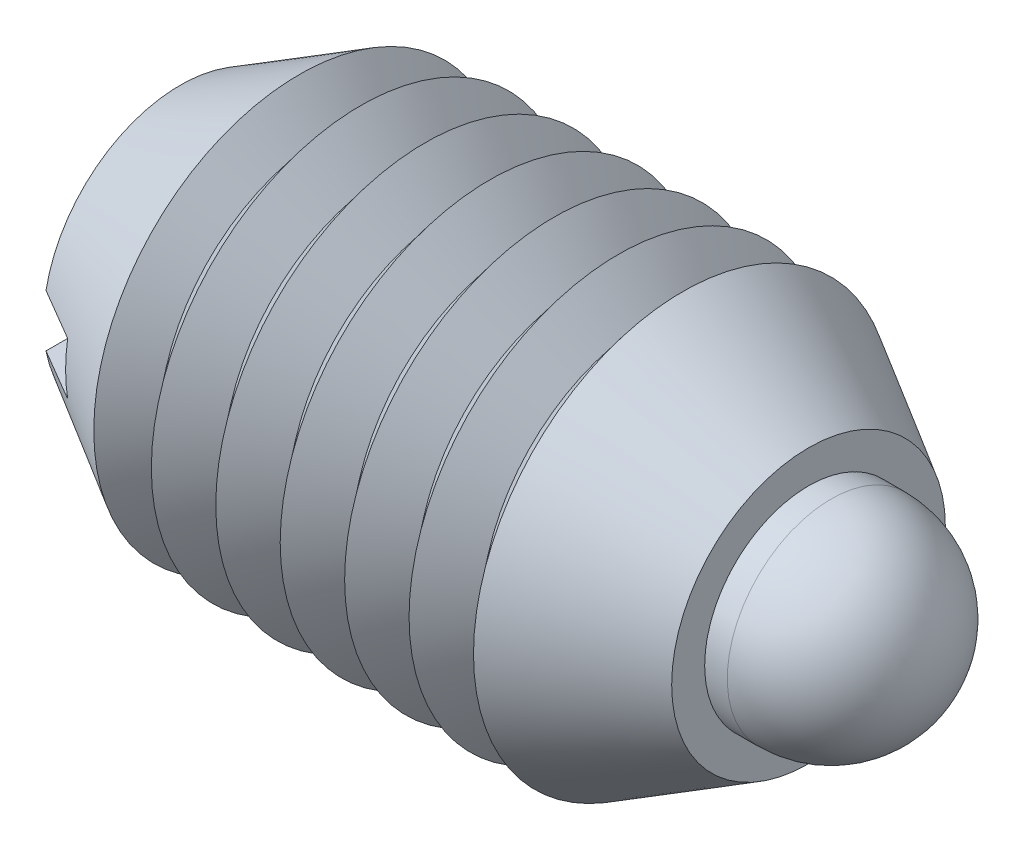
ISO-10303-21;
HEADER;
FILE_DESCRIPTION(('STEP AP214'),'2;1');
FILE_NAME('part.step','',(''),(''),'','','');
FILE_SCHEMA(('AUTOMOTIVE_DESIGN { 1 0 10303 214 1 1 1 1 }'));
ENDSEC;
DATA;
#1=APPLICATION_CONTEXT('core data for automotive mechanical design processes');
#2=APPLICATION_PROTOCOL_DEFINITION('international standard','automotive_design',2000,#1);
#3=PRODUCT_CONTEXT('',#1,'mechanical');
#4=PRODUCT('Part','Part','',(#3));
#5=PRODUCT_RELATED_PRODUCT_CATEGORY('part','',(#4));
#6=PRODUCT_DEFINITION_FORMATION('','',#4);
#7=PRODUCT_DEFINITION_CONTEXT('part definition',#1,'design');
#8=PRODUCT_DEFINITION('design','',#6,#7);
#9=PRODUCT_DEFINITION_SHAPE('','',#8);
#10=(LENGTH_UNIT() NAMED_UNIT(*) SI_UNIT(.MILLI.,.METRE.));
#11=(NAMED_UNIT(*) PLANE_ANGLE_UNIT() SI_UNIT($,.RADIAN.));
#12=(NAMED_UNIT(*) SI_UNIT($,.STERADIAN.) SOLID_ANGLE_UNIT());
#13=UNCERTAINTY_MEASURE_WITH_UNIT(LENGTH_MEASURE(1.E-05),#10,'distance_accuracy_value','');
#14=(GEOMETRIC_REPRESENTATION_CONTEXT(3) GLOBAL_UNCERTAINTY_ASSIGNED_CONTEXT((#13)) GLOBAL_UNIT_ASSIGNED_CONTEXT((#10,
#11,#12)) REPRESENTATION_CONTEXT('',''));
#15=CARTESIAN_POINT('',(0.,0.,0.));
#16=DIRECTION('',(0.,0.,1.));
#17=DIRECTION('',(1.,0.,0.));
#18=AXIS2_PLACEMENT_3D('',#15,#16,#17);
#19=CARTESIAN_POINT('',(11.80592,0.,0.));
#20=DIRECTION('',(-1.,0.,0.));
#21=DIRECTION('',(0.,-0.719424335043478,-0.694570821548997));
#22=AXIS2_PLACEMENT_3D('',#19,#20,#21);
#23=PLANE('',#22);
#24=CARTESIAN_POINT('',(11.80592,0.,0.));
#25=DIRECTION('',(1.,0.,0.));
#26=DIRECTION('',(0.,0.719424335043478,0.694570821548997));
#27=AXIS2_PLACEMENT_3D('',#24,#25,#26);
#28=CIRCLE('',#27,3.1496);
#29=CARTESIAN_POINT('',(11.80592,2.26589888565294,2.18762025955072));
#30=VERTEX_POINT('',#29);
#31=EDGE_CURVE('P0_E10',#30,#30,#28,.T.);
#32=ORIENTED_EDGE('',*,*,#31,.F.);
#33=EDGE_LOOP('',(#32));
#34=FACE_BOUND('',#33,.T.);
#35=ADVANCED_FACE('P0_F14',(#34),#23,.T.);
#36=CARTESIAN_POINT('',(12.43584,0.,0.));
#37=DIRECTION('',(1.,0.,0.));
#38=DIRECTION('',(0.,0.719424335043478,0.694570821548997));
#39=AXIS2_PLACEMENT_3D('',#36,#37,#38);
#40=CONICAL_SURFACE('',#39,3.77952,0.785398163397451);
#41=ORIENTED_EDGE('',*,*,#31,.T.);
#42=EDGE_LOOP('',(#41));
#43=FACE_BOUND('',#42,.T.);
#44=CARTESIAN_POINT('',(12.43584,0.,0.));
#45=DIRECTION('',(1.,0.,0.));
#46=DIRECTION('',(0.,0.719424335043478,0.694570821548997));
#47=AXIS2_PLACEMENT_3D('',#44,#45,#46);
#48=CIRCLE('',#47,3.77952);
#49=CARTESIAN_POINT('',(12.43584,2.71907866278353,2.62514431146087));
#50=VERTEX_POINT('',#49);
#51=EDGE_CURVE('P0_E20',#50,#50,#48,.T.);
#52=ORIENTED_EDGE('',*,*,#51,.F.);
#53=EDGE_LOOP('',(#52));
#54=FACE_BOUND('',#53,.T.);
#55=ADVANCED_FACE('P0_F54',(#43,#54),#40,.T.);
#56=CARTESIAN_POINT('',(22.8854,0.,0.));
#57=DIRECTION('',(1.,0.,0.));
#58=DIRECTION('',(0.,0.719424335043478,0.694570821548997));
#59=AXIS2_PLACEMENT_3D('',#56,#57,#58);
#60=CYLINDRICAL_SURFACE('',#59,3.77952);
#61=ORIENTED_EDGE('',*,*,#51,.T.);
#62=EDGE_LOOP('',(#61));
#63=FACE_BOUND('',#62,.T.);
#64=CARTESIAN_POINT('',(17.0140665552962,0.,0.));
#65=DIRECTION('',(1.,0.,0.));
#66=DIRECTION('',(0.,0.719424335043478,0.694570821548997));
#67=AXIS2_PLACEMENT_3D('',#64,#65,#66);
#68=CIRCLE('',#67,3.77952);
#69=CARTESIAN_POINT('',(17.0140665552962,2.71907866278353,2.62514431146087));
#70=VERTEX_POINT('',#69);
#71=EDGE_CURVE('P0_E24',#70,#70,#68,.T.);
#72=ORIENTED_EDGE('',*,*,#71,.F.);
#73=EDGE_LOOP('',(#72));
#74=FACE_BOUND('',#73,.T.);
#75=ADVANCED_FACE('P0_F50',(#63,#74),#60,.T.);
#76=CARTESIAN_POINT('',(18.10512,0.,0.));
#77=DIRECTION('',(-1.,0.,0.));
#78=DIRECTION('',(0.,-0.719424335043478,-0.694570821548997));
#79=AXIS2_PLACEMENT_3D('',#76,#77,#78);
#80=CONICAL_SURFACE('',#79,3.1496,0.523598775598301);
#81=ORIENTED_EDGE('',*,*,#71,.T.);
#82=EDGE_LOOP('',(#81));
#83=FACE_BOUND('',#82,.T.);
#84=CARTESIAN_POINT('',(18.10512,0.,0.));
#85=DIRECTION('',(1.,0.,0.));
#86=DIRECTION('',(0.,0.719424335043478,0.694570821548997));
#87=AXIS2_PLACEMENT_3D('',#84,#85,#86);
#88=CIRCLE('',#87,3.1496);
#89=CARTESIAN_POINT('',(18.10512,2.26589888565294,2.18762025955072));
#90=VERTEX_POINT('',#89);
#91=EDGE_CURVE('P0_E28',#90,#90,#88,.T.);
#92=ORIENTED_EDGE('',*,*,#91,.F.);
#93=EDGE_LOOP('',(#92));
#94=FACE_BOUND('',#93,.T.);
#95=ADVANCED_FACE('P0_F41',(#83,#94),#80,.T.);
#96=CARTESIAN_POINT('',(22.8854,0.,0.));
#97=DIRECTION('',(1.,0.,0.));
#98=DIRECTION('',(0.,0.719424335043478,0.694570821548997));
#99=AXIS2_PLACEMENT_3D('',#96,#97,#98);
#100=CYLINDRICAL_SURFACE('',#99,3.1496);
#101=ORIENTED_EDGE('',*,*,#91,.T.);
#102=EDGE_LOOP('',(#101));
#103=FACE_BOUND('',#102,.T.);
#104=CARTESIAN_POINT('',(19.7358,0.,0.));
#105=DIRECTION('',(1.,0.,0.));
#106=DIRECTION('',(0.,0.719424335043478,0.694570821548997));
#107=AXIS2_PLACEMENT_3D('',#104,#105,#106);
#108=CIRCLE('',#107,3.1496);
#109=CARTESIAN_POINT('',(19.7358,2.26589888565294,2.18762025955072));
#110=VERTEX_POINT('',#109);
#111=EDGE_CURVE('P0_E33',#110,#110,#108,.T.);
#112=ORIENTED_EDGE('',*,*,#111,.F.);
#113=EDGE_LOOP('',(#112));
#114=FACE_BOUND('',#113,.T.);
#115=ADVANCED_FACE('P0_F39',(#103,#114),#100,.T.);
#116=CARTESIAN_POINT('',(19.7358,0.,0.));
#117=DIRECTION('',(1.,0.,0.));
#118=DIRECTION('',(0.,0.719424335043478,0.694570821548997));
#119=AXIS2_PLACEMENT_3D('',#116,#117,#118);
#120=SPHERICAL_SURFACE('',#119,3.1496);
#121=ORIENTED_EDGE('',*,*,#111,.T.);
#122=EDGE_LOOP('',(#121));
#123=FACE_BOUND('',#122,.T.);
#124=ADVANCED_FACE('P0_F37',(#123),#120,.T.);
#125=CLOSED_SHELL('',(#35,#55,#75,#95,#115,#124));
#126=MANIFOLD_SOLID_BREP('P0_B1',#125);
#127=CARTESIAN_POINT('',(19.05,0.,0.));
#128=DIRECTION('',(1.,0.,0.));
#129=DIRECTION('',(0.,0.,-1.));
#130=AXIS2_PLACEMENT_3D('',#127,#128,#129);
#131=PLANE('',#130);
#132=CARTESIAN_POINT('',(19.05,0.,0.));
#133=DIRECTION('',(1.,0.,0.));
#134=DIRECTION('',(0.,0.,-1.));
#135=AXIS2_PLACEMENT_3D('',#132,#133,#134);
#136=CIRCLE('',#135,4.15029547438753);
#137=CARTESIAN_POINT('',(19.05,0.,-4.15029547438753));
#138=VERTEX_POINT('',#137);
#139=EDGE_CURVE('P1_E78',#138,#138,#136,.T.);
#140=ORIENTED_EDGE('',*,*,#139,.T.);
#141=EDGE_LOOP('',(#140));
#142=FACE_BOUND('',#141,.T.);
#143=CARTESIAN_POINT('',(19.05,0.,0.));
#144=DIRECTION('',(-1.,0.,0.));
#145=DIRECTION('',(0.,0.,1.));
#146=AXIS2_PLACEMENT_3D('',#143,#144,#145);
#147=CIRCLE('',#146,3.1496);
#148=CARTESIAN_POINT('',(19.05,0.,3.1496));
#149=VERTEX_POINT('',#148);
#150=EDGE_CURVE('P1_E65',#149,#149,#147,.T.);
#151=ORIENTED_EDGE('',*,*,#150,.T.);
#152=EDGE_LOOP('',(#151));
#153=FACE_BOUND('',#152,.T.);
#154=ADVANCED_FACE('P1_F15',(#142,#153),#131,.T.);
#155=CARTESIAN_POINT('',(19.05,0.,0.));
#156=DIRECTION('',(-1.,0.,0.));
#157=DIRECTION('',(0.,0.,1.));
#158=AXIS2_PLACEMENT_3D('',#155,#156,#157);
#159=CONICAL_SURFACE('',#158,4.15029547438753,0.523598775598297);
#160=CARTESIAN_POINT('',(15.24,0.,0.));
#161=DIRECTION('',(-1.,0.,0.));
#162=DIRECTION('',(0.,0.,1.));
#163=AXIS2_PLACEMENT_3D('',#160,#161,#162);
#164=CIRCLE('',#163,6.35);
#165=CARTESIAN_POINT('',(15.24,0.,6.35));
#166=VERTEX_POINT('',#165);
#167=EDGE_CURVE('P1_E127',#166,#166,#164,.T.);
#168=ORIENTED_EDGE('',*,*,#167,.F.);
#169=EDGE_LOOP('',(#168));
#170=FACE_BOUND('',#169,.T.);
#171=ORIENTED_EDGE('',*,*,#139,.F.);
#172=EDGE_LOOP('',(#171));
#173=FACE_BOUND('',#172,.T.);
#174=ADVANCED_FACE('P1_F17',(#170,#173),#159,.T.);
#175=CARTESIAN_POINT('',(0.,0.,0.));
#176=DIRECTION('',(-1.,0.,0.));
#177=DIRECTION('',(0.,0.,1.));
#178=AXIS2_PLACEMENT_3D('',#175,#176,#177);
#179=CYLINDRICAL_SURFACE('',#178,3.1496);
#180=CARTESIAN_POINT('',(18.10512,0.,0.));
#181=DIRECTION('',(-1.,0.,0.));
#182=DIRECTION('',(0.,0.,1.));
#183=AXIS2_PLACEMENT_3D('',#180,#181,#182);
#184=CIRCLE('',#183,3.1496);
#185=CARTESIAN_POINT('',(18.10512,0.,3.1496));
#186=VERTEX_POINT('',#185);
#187=EDGE_CURVE('P1_E115',#186,#186,#184,.T.);
#188=ORIENTED_EDGE('',*,*,#187,.T.);
#189=EDGE_LOOP('',(#188));
#190=FACE_BOUND('',#189,.T.);
#191=ORIENTED_EDGE('',*,*,#150,.F.);
#192=EDGE_LOOP('',(#191));
#193=FACE_BOUND('',#192,.T.);
#194=ADVANCED_FACE('P1_F184',(#190,#193),#179,.F.);
#195=CARTESIAN_POINT('',(18.10512,0.,0.));
#196=DIRECTION('',(-1.,0.,0.));
#197=DIRECTION('',(0.,0.,1.));
#198=AXIS2_PLACEMENT_3D('',#195,#196,#197);
#199=CONICAL_SURFACE('',#198,3.1496,0.785398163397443);
#200=CARTESIAN_POINT('',(17.4752,0.,0.));
#201=DIRECTION('',(-1.,0.,0.));
#202=DIRECTION('',(0.,0.,1.));
#203=AXIS2_PLACEMENT_3D('',#200,#201,#202);
#204=CIRCLE('',#203,3.77952);
#205=CARTESIAN_POINT('',(17.4752,0.,3.77952));
#206=VERTEX_POINT('',#205);
#207=EDGE_CURVE('P1_E118',#206,#206,#204,.T.);
#208=ORIENTED_EDGE('',*,*,#207,.T.);
#209=EDGE_LOOP('',(#208));
#210=FACE_BOUND('',#209,.T.);
#211=ORIENTED_EDGE('',*,*,#187,.F.);
#212=EDGE_LOOP('',(#211));
#213=FACE_BOUND('',#212,.T.);
#214=ADVANCED_FACE('P1_F191',(#210,#213),#199,.F.);
#215=CARTESIAN_POINT('',(0.,0.,0.));
#216=DIRECTION('',(-1.,0.,0.));
#217=DIRECTION('',(0.,0.,1.));
#218=AXIS2_PLACEMENT_3D('',#215,#216,#217);
#219=CYLINDRICAL_SURFACE('',#218,3.77952);
#220=CARTESIAN_POINT('',(4.7625,0.,0.));
#221=DIRECTION('',(-1.,0.,0.));
#222=DIRECTION('',(0.,0.,1.));
#223=AXIS2_PLACEMENT_3D('',#220,#221,#222);
#224=CIRCLE('',#223,3.77952);
#225=CARTESIAN_POINT('',(4.7625,0.,3.77952));
#226=VERTEX_POINT('',#225);
#227=EDGE_CURVE('P1_E121',#226,#226,#224,.T.);
#228=ORIENTED_EDGE('',*,*,#227,.T.);
#229=EDGE_LOOP('',(#228));
#230=FACE_BOUND('',#229,.T.);
#231=ORIENTED_EDGE('',*,*,#207,.F.);
#232=EDGE_LOOP('',(#231));
#233=FACE_BOUND('',#232,.T.);
#234=ADVANCED_FACE('P1_F196',(#230,#233),#219,.F.);
#235=CARTESIAN_POINT('',(4.7625,0.,0.));
#236=DIRECTION('',(1.,0.,0.));
#237=DIRECTION('',(0.,0.,-1.));
#238=AXIS2_PLACEMENT_3D('',#235,#236,#237);
#239=PLANE('',#238);
#240=ORIENTED_EDGE('',*,*,#227,.F.);
#241=EDGE_LOOP('',(#240));
#242=FACE_BOUND('',#241,.T.);
#243=ADVANCED_FACE('P1_F202',(#242),#239,.T.);
#244=CARTESIAN_POINT('',(14.2630769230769,0.,0.));
#245=DIRECTION('',(1.,0.,0.));
#246=DIRECTION('',(0.,0.,-1.));
#247=AXIS2_PLACEMENT_3D('',#244,#245,#246);
#248=CONICAL_SURFACE('',#247,5.12982346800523,0.895664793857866);
#249=ORIENTED_EDGE('',*,*,#167,.T.);
#250=EDGE_LOOP('',(#249));
#251=FACE_BOUND('',#250,.T.);
#252=CARTESIAN_POINT('',(14.2630769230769,0.,0.));
#253=DIRECTION('',(-1.,0.,0.));
#254=DIRECTION('',(0.,0.,1.));
#255=AXIS2_PLACEMENT_3D('',#252,#253,#254);
#256=CIRCLE('',#255,5.12982346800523);
#257=CARTESIAN_POINT('',(14.2630769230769,0.,5.12982346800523));
#258=VERTEX_POINT('',#257);
#259=EDGE_CURVE('P1_E124',#258,#258,#256,.T.);
#260=ORIENTED_EDGE('',*,*,#259,.F.);
#261=EDGE_LOOP('',(#260));
#262=FACE_BOUND('',#261,.T.);
#263=ADVANCED_FACE('P1_F206',(#251,#262),#248,.T.);
#264=CARTESIAN_POINT('',(13.2861538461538,0.,0.));
#265=DIRECTION('',(-1.,0.,0.));
#266=DIRECTION('',(0.,0.,1.));
#267=AXIS2_PLACEMENT_3D('',#264,#265,#266);
#268=CONICAL_SURFACE('',#267,6.35,0.895664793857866);
#269=ORIENTED_EDGE('',*,*,#259,.T.);
#270=EDGE_LOOP('',(#269));
#271=FACE_BOUND('',#270,.T.);
#272=CARTESIAN_POINT('',(13.2861538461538,0.,0.));
#273=DIRECTION('',(-1.,0.,0.));
#274=DIRECTION('',(0.,0.,1.));
#275=AXIS2_PLACEMENT_3D('',#272,#273,#274);
#276=CIRCLE('',#275,6.35);
#277=CARTESIAN_POINT('',(13.2861538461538,0.,6.35));
#278=VERTEX_POINT('',#277);
#279=EDGE_CURVE('P1_E133',#278,#278,#276,.T.);
#280=ORIENTED_EDGE('',*,*,#279,.F.);
#281=EDGE_LOOP('',(#280));
#282=FACE_BOUND('',#281,.T.);
#283=ADVANCED_FACE('P1_F210',(#271,#282),#268,.T.);
#284=CARTESIAN_POINT('',(12.3092307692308,0.,0.));
#285=DIRECTION('',(1.,0.,0.));
#286=DIRECTION('',(0.,0.,-1.));
#287=AXIS2_PLACEMENT_3D('',#284,#285,#286);
#288=CONICAL_SURFACE('',#287,5.12982346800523,0.895664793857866);
#289=ORIENTED_EDGE('',*,*,#279,.T.);
#290=EDGE_LOOP('',(#289));
#291=FACE_BOUND('',#290,.T.);
#292=CARTESIAN_POINT('',(12.3092307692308,0.,0.));
#293=DIRECTION('',(-1.,0.,0.));
#294=DIRECTION('',(0.,0.,1.));
#295=AXIS2_PLACEMENT_3D('',#292,#293,#294);
#296=CIRCLE('',#295,5.12982346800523);
#297=CARTESIAN_POINT('',(12.3092307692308,0.,5.12982346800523));
#298=VERTEX_POINT('',#297);
#299=EDGE_CURVE('P1_E130',#298,#298,#296,.T.);
#300=ORIENTED_EDGE('',*,*,#299,.F.);
#301=EDGE_LOOP('',(#300));
#302=FACE_BOUND('',#301,.T.);
#303=ADVANCED_FACE('P1_F214',(#291,#302),#288,.T.);
#304=CARTESIAN_POINT('',(11.3323076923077,0.,0.));
#305=DIRECTION('',(-1.,0.,0.));
#306=DIRECTION('',(0.,0.,1.));
#307=AXIS2_PLACEMENT_3D('',#304,#305,#306);
#308=CONICAL_SURFACE('',#307,6.35,0.895664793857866);
#309=ORIENTED_EDGE('',*,*,#299,.T.);
#310=EDGE_LOOP('',(#309));
#311=FACE_BOUND('',#310,.T.);
#312=CARTESIAN_POINT('',(11.3323076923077,0.,0.));
#313=DIRECTION('',(-1.,0.,0.));
#314=DIRECTION('',(0.,0.,1.));
#315=AXIS2_PLACEMENT_3D('',#312,#313,#314);
#316=CIRCLE('',#315,6.35);
#317=CARTESIAN_POINT('',(11.3323076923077,0.,6.35));
#318=VERTEX_POINT('',#317);
#319=EDGE_CURVE('P1_E139',#318,#318,#316,.T.);
#320=ORIENTED_EDGE('',*,*,#319,.F.);
#321=EDGE_LOOP('',(#320));
#322=FACE_BOUND('',#321,.T.);
#323=ADVANCED_FACE('P1_F218',(#311,#322),#308,.T.);
#324=CARTESIAN_POINT('',(10.3553846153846,0.,0.));
#325=DIRECTION('',(1.,0.,0.));
#326=DIRECTION('',(0.,0.,-1.));
#327=AXIS2_PLACEMENT_3D('',#324,#325,#326);
#328=CONICAL_SURFACE('',#327,5.12982346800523,0.895664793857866);
#329=ORIENTED_EDGE('',*,*,#319,.T.);
#330=EDGE_LOOP('',(#329));
#331=FACE_BOUND('',#330,.T.);
#332=CARTESIAN_POINT('',(10.3553846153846,0.,0.));
#333=DIRECTION('',(-1.,0.,0.));
#334=DIRECTION('',(0.,0.,1.));
#335=AXIS2_PLACEMENT_3D('',#332,#333,#334);
#336=CIRCLE('',#335,5.12982346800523);
#337=CARTESIAN_POINT('',(10.3553846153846,0.,5.12982346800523));
#338=VERTEX_POINT('',#337);
#339=EDGE_CURVE('P1_E136',#338,#338,#336,.T.);
#340=ORIENTED_EDGE('',*,*,#339,.F.);
#341=EDGE_LOOP('',(#340));
#342=FACE_BOUND('',#341,.T.);
#343=ADVANCED_FACE('P1_F222',(#331,#342),#328,.T.);
#344=CARTESIAN_POINT('',(9.37846153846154,0.,0.));
#345=DIRECTION('',(-1.,0.,0.));
#346=DIRECTION('',(0.,0.,1.));
#347=AXIS2_PLACEMENT_3D('',#344,#345,#346);
#348=CONICAL_SURFACE('',#347,6.35,0.895664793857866);
#349=ORIENTED_EDGE('',*,*,#339,.T.);
#350=EDGE_LOOP('',(#349));
#351=FACE_BOUND('',#350,.T.);
#352=CARTESIAN_POINT('',(9.37846153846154,0.,0.));
#353=DIRECTION('',(-1.,0.,0.));
#354=DIRECTION('',(0.,0.,1.));
#355=AXIS2_PLACEMENT_3D('',#352,#353,#354);
#356=CIRCLE('',#355,6.35);
#357=CARTESIAN_POINT('',(9.37846153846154,0.,6.35));
#358=VERTEX_POINT('',#357);
#359=EDGE_CURVE('P1_E145',#358,#358,#356,.T.);
#360=ORIENTED_EDGE('',*,*,#359,.F.);
#361=EDGE_LOOP('',(#360));
#362=FACE_BOUND('',#361,.T.);
#363=ADVANCED_FACE('P1_F226',(#351,#362),#348,.T.);
#364=CARTESIAN_POINT('',(8.40153846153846,0.,0.));
#365=DIRECTION('',(1.,0.,0.));
#366=DIRECTION('',(0.,0.,-1.));
#367=AXIS2_PLACEMENT_3D('',#364,#365,#366);
#368=CONICAL_SURFACE('',#367,5.12982346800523,0.895664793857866);
#369=ORIENTED_EDGE('',*,*,#359,.T.);
#370=EDGE_LOOP('',(#369));
#371=FACE_BOUND('',#370,.T.);
#372=CARTESIAN_POINT('',(8.40153846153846,0.,0.));
#373=DIRECTION('',(-1.,0.,0.));
#374=DIRECTION('',(0.,0.,1.));
#375=AXIS2_PLACEMENT_3D('',#372,#373,#374);
#376=CIRCLE('',#375,5.12982346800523);
#377=CARTESIAN_POINT('',(8.40153846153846,0.,5.12982346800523));
#378=VERTEX_POINT('',#377);
#379=EDGE_CURVE('P1_E142',#378,#378,#376,.T.);
#380=ORIENTED_EDGE('',*,*,#379,.F.);
#381=EDGE_LOOP('',(#380));
#382=FACE_BOUND('',#381,.T.);
#383=ADVANCED_FACE('P1_F230',(#371,#382),#368,.T.);
#384=CARTESIAN_POINT('',(7.42461538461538,0.,0.));
#385=DIRECTION('',(-1.,0.,0.));
#386=DIRECTION('',(0.,0.,1.));
#387=AXIS2_PLACEMENT_3D('',#384,#385,#386);
#388=CONICAL_SURFACE('',#387,6.35,0.895664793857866);
#389=ORIENTED_EDGE('',*,*,#379,.T.);
#390=EDGE_LOOP('',(#389));
#391=FACE_BOUND('',#390,.T.);
#392=CARTESIAN_POINT('',(7.42461538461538,0.,0.));
#393=DIRECTION('',(-1.,0.,0.));
#394=DIRECTION('',(0.,0.,1.));
#395=AXIS2_PLACEMENT_3D('',#392,#393,#394);
#396=CIRCLE('',#395,6.35);
#397=CARTESIAN_POINT('',(7.42461538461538,0.,6.35));
#398=VERTEX_POINT('',#397);
#399=EDGE_CURVE('P1_E151',#398,#398,#396,.T.);
#400=ORIENTED_EDGE('',*,*,#399,.F.);
#401=EDGE_LOOP('',(#400));
#402=FACE_BOUND('',#401,.T.);
#403=ADVANCED_FACE('P1_F176',(#391,#402),#388,.T.);
#404=CARTESIAN_POINT('',(6.44769230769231,0.,0.));
#405=DIRECTION('',(1.,0.,0.));
#406=DIRECTION('',(0.,0.,-1.));
#407=AXIS2_PLACEMENT_3D('',#404,#405,#406);
#408=CONICAL_SURFACE('',#407,5.12982346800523,0.895664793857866);
#409=ORIENTED_EDGE('',*,*,#399,.T.);
#410=EDGE_LOOP('',(#409));
#411=FACE_BOUND('',#410,.T.);
#412=CARTESIAN_POINT('',(6.44769230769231,0.,0.));
#413=DIRECTION('',(-1.,0.,0.));
#414=DIRECTION('',(0.,0.,1.));
#415=AXIS2_PLACEMENT_3D('',#412,#413,#414);
#416=CIRCLE('',#415,5.12982346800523);
#417=CARTESIAN_POINT('',(6.44769230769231,0.,5.12982346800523));
#418=VERTEX_POINT('',#417);
#419=EDGE_CURVE('P1_E148',#418,#418,#416,.T.);
#420=ORIENTED_EDGE('',*,*,#419,.F.);
#421=EDGE_LOOP('',(#420));
#422=FACE_BOUND('',#421,.T.);
#423=ADVANCED_FACE('P1_F166',(#411,#422),#408,.T.);
#424=CARTESIAN_POINT('',(5.47076923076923,0.,0.));
#425=DIRECTION('',(-1.,0.,0.));
#426=DIRECTION('',(0.,0.,1.));
#427=AXIS2_PLACEMENT_3D('',#424,#425,#426);
#428=CONICAL_SURFACE('',#427,6.35,0.895664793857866);
#429=ORIENTED_EDGE('',*,*,#419,.T.);
#430=EDGE_LOOP('',(#429));
#431=FACE_BOUND('',#430,.T.);
#432=CARTESIAN_POINT('',(5.47076923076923,0.,0.));
#433=DIRECTION('',(-1.,0.,0.));
#434=DIRECTION('',(0.,0.,1.));
#435=AXIS2_PLACEMENT_3D('',#432,#433,#434);
#436=CIRCLE('',#435,6.35);
#437=CARTESIAN_POINT('',(5.47076923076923,0.,6.35));
#438=VERTEX_POINT('',#437);
#439=EDGE_CURVE('P1_E157',#438,#438,#436,.T.);
#440=ORIENTED_EDGE('',*,*,#439,.F.);
#441=EDGE_LOOP('',(#440));
#442=FACE_BOUND('',#441,.T.);
#443=ADVANCED_FACE('P1_F164',(#431,#442),#428,.T.);
#444=CARTESIAN_POINT('',(4.49384615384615,0.,0.));
#445=DIRECTION('',(1.,0.,0.));
#446=DIRECTION('',(0.,0.,-1.));
#447=AXIS2_PLACEMENT_3D('',#444,#445,#446);
#448=CONICAL_SURFACE('',#447,5.12982346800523,0.895664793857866);
#449=ORIENTED_EDGE('',*,*,#439,.T.);
#450=EDGE_LOOP('',(#449));
#451=FACE_BOUND('',#450,.T.);
#452=CARTESIAN_POINT('',(4.49384615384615,0.,0.));
#453=DIRECTION('',(-1.,0.,0.));
#454=DIRECTION('',(0.,0.,1.));
#455=AXIS2_PLACEMENT_3D('',#452,#453,#454);
#456=CIRCLE('',#455,5.12982346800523);
#457=CARTESIAN_POINT('',(4.49384615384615,0.,5.12982346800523));
#458=VERTEX_POINT('',#457);
#459=EDGE_CURVE('P1_E154',#458,#458,#456,.T.);
#460=ORIENTED_EDGE('',*,*,#459,.F.);
#461=EDGE_LOOP('',(#460));
#462=FACE_BOUND('',#461,.T.);
#463=ADVANCED_FACE('P1_F161',(#451,#462),#448,.T.);
#464=CARTESIAN_POINT('',(3.51692307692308,0.,0.));
#465=DIRECTION('',(-1.,0.,0.));
#466=DIRECTION('',(0.,0.,1.));
#467=AXIS2_PLACEMENT_3D('',#464,#465,#466);
#468=CONICAL_SURFACE('',#467,6.35,0.895664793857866);
#469=CARTESIAN_POINT('',(3.60957128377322,0.,0.));
#470=DIRECTION('',(-1.,0.,0.));
#471=DIRECTION('',(0.,0.,1.));
#472=AXIS2_PLACEMENT_3D('',#469,#470,#471);
#473=CIRCLE('',#472,6.23428242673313);
#474=CARTESIAN_POINT('',(3.60957128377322,0.,6.23428242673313));
#475=VERTEX_POINT('',#474);
#476=EDGE_CURVE('P1_E19',#475,#475,#473,.T.);
#477=ORIENTED_EDGE('',*,*,#476,.F.);
#478=EDGE_LOOP('',(#477));
#479=FACE_BOUND('',#478,.T.);
#480=ORIENTED_EDGE('',*,*,#459,.T.);
#481=EDGE_LOOP('',(#480));
#482=FACE_BOUND('',#481,.T.);
#483=ADVANCED_FACE('P1_F174',(#479,#482),#468,.T.);
#484=CARTESIAN_POINT('',(0.,0.,0.));
#485=DIRECTION('',(1.,0.,0.));
#486=DIRECTION('',(0.,0.,-1.));
#487=AXIS2_PLACEMENT_3D('',#484,#485,#486);
#488=PLANE('',#487);
#489=CARTESIAN_POINT('',(0.,0.,0.));
#490=DIRECTION('',(1.,0.,0.));
#491=DIRECTION('',(0.,0.,-1.));
#492=AXIS2_PLACEMENT_3D('',#489,#490,#491);
#493=CIRCLE('',#492,4.15029547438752);
#494=CARTESIAN_POINT('',(0.,-0.79375,-4.07368548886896));
#495=VERTEX_POINT('',#494);
#496=CARTESIAN_POINT('',(0.,-0.79375,4.07368548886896));
#497=VERTEX_POINT('',#496);
#498=EDGE_CURVE('P1_E74',#495,#497,#493,.F.);
#499=ORIENTED_EDGE('',*,*,#498,.T.);
#500=DIRECTION('',(0.,0.,1.));
#501=VECTOR('',#500,1.);
#502=CARTESIAN_POINT('',(0.,-0.79375,-6.35));
#503=LINE('',#502,#501);
#504=EDGE_CURVE('P1_E32',#495,#497,#503,.T.);
#505=ORIENTED_EDGE('',*,*,#504,.F.);
#506=EDGE_LOOP('',(#499,#505));
#507=FACE_BOUND('',#506,.T.);
#508=ADVANCED_FACE('P1_F100',(#507),#488,.F.);
#509=CARTESIAN_POINT('',(0.,-0.79375,-6.35));
#510=DIRECTION('',(0.,-1.,0.));
#511=DIRECTION('',(0.,0.,-1.));
#512=AXIS2_PLACEMENT_3D('',#509,#510,#511);
#513=PLANE('',#512);
#514=CARTESIAN_POINT('',(9.26700050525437,-0.79375,-9.46738479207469));
#515=CARTESIAN_POINT('',(8.80431673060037,-0.79375,-9.19931314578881));
#516=CARTESIAN_POINT('',(8.34166426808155,-0.79375,-8.93118741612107));
#517=CARTESIAN_POINT('',(7.41644962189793,-0.79375,-8.39477910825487));
#518=CARTESIAN_POINT('',(6.9538874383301,-0.79375,-8.12649652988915));
#519=CARTESIAN_POINT('',(6.0287909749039,-0.79375,-7.58967359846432));
#520=CARTESIAN_POINT('',(5.56625671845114,-0.79375,-7.32113320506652));
#521=CARTESIAN_POINT('',(4.64135332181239,-0.79375,-6.78376910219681));
#522=CARTESIAN_POINT('',(4.17898418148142,-0.79375,-6.51494539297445));
#523=CARTESIAN_POINT('',(3.26653599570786,-0.79375,-5.98390649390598));
#524=CARTESIAN_POINT('',(2.81645086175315,-0.79375,-5.72170176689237));
#525=CARTESIAN_POINT('',(1.91661277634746,-0.79375,-5.19671987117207));
#526=CARTESIAN_POINT('',(1.46685982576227,-0.79375,-4.9339427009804));
#527=CARTESIAN_POINT('',(0.567964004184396,-0.79375,-4.40752360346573));
#528=CARTESIAN_POINT('',(0.118821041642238,-0.79375,-4.14388183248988));
#529=CARTESIAN_POINT('',(-0.778562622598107,-0.79375,-3.61506894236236));
#530=CARTESIAN_POINT('',(-1.22680332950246,-0.79375,-3.34989783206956));
#531=CARTESIAN_POINT('',(-1.89903026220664,-0.79375,-2.9491170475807));
#532=CARTESIAN_POINT('',(-2.12369596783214,-0.79375,-2.81464860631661));
#533=CARTESIAN_POINT('',(-2.57238661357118,-0.79375,-2.54447351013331));
#534=CARTESIAN_POINT('',(-2.79641130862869,-0.79375,-2.40876644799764));
#535=CARTESIAN_POINT('',(-3.24563110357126,-0.79375,-2.13405966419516));
#536=CARTESIAN_POINT('',(-3.4708143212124,-0.79375,-1.99504040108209));
#537=CARTESIAN_POINT('',(-3.80685440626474,-0.79375,-1.78398485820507));
#538=CARTESIAN_POINT('',(-3.91852493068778,-0.79375,-1.71324680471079));
#539=CARTESIAN_POINT('',(-4.14106975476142,-0.79375,-1.57053724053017));
#540=CARTESIAN_POINT('',(-4.25194408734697,-0.79375,-1.49856578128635));
#541=CARTESIAN_POINT('',(-4.47260870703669,-0.79375,-1.35276153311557));
#542=CARTESIAN_POINT('',(-4.58239798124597,-0.79375,-1.27892719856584));
#543=CARTESIAN_POINT('',(-4.74576549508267,-0.79375,-1.1659356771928));
#544=CARTESIAN_POINT('',(-4.80007851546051,-0.79375,-1.12784251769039));
#545=CARTESIAN_POINT('',(-4.90802998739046,-0.79375,-1.05072747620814));
#546=CARTESIAN_POINT('',(-4.96166855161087,-0.79375,-1.01170575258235));
#547=CARTESIAN_POINT('',(-5.06751153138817,-0.79375,-0.932813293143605));
#548=CARTESIAN_POINT('',(-5.11972482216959,-0.79375,-0.892954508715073));
#549=CARTESIAN_POINT('',(-5.22285303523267,-0.79375,-0.811594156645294));
#550=CARTESIAN_POINT('',(-5.27376820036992,-0.79375,-0.770092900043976));
#551=CARTESIAN_POINT('',(-5.37341306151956,-0.79375,-0.68494623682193));
#552=CARTESIAN_POINT('',(-5.422151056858,-0.79375,-0.641310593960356));
#553=CARTESIAN_POINT('',(-5.51640185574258,-0.79375,-0.550712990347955));
#554=CARTESIAN_POINT('',(-5.56191980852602,-0.79375,-0.503756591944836));
#555=CARTESIAN_POINT('',(-5.61979494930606,-0.79375,-0.436457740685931));
#556=CARTESIAN_POINT('',(-5.63471523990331,-0.79375,-0.418336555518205));
#557=CARTESIAN_POINT('',(-5.66356321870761,-0.79375,-0.381316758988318));
#558=CARTESIAN_POINT('',(-5.67749044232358,-0.79375,-0.362417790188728));
#559=CARTESIAN_POINT('',(-5.71729038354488,-0.79375,-0.304510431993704));
#560=CARTESIAN_POINT('',(-5.74132243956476,-0.79375,-0.264135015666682));
#561=CARTESIAN_POINT('',(-5.77323761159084,-0.79375,-0.195615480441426));
#562=CARTESIAN_POINT('',(-5.78377810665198,-0.79375,-0.168729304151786));
#563=CARTESIAN_POINT('',(-5.80048650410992,-0.79375,-0.113615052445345));
#564=CARTESIAN_POINT('',(-5.80666024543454,-0.79375,-0.0853888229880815));
#565=CARTESIAN_POINT('',(-5.81374870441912,-0.79375,-0.0280057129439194));
#566=CARTESIAN_POINT('',(-5.81461783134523,-0.79375,0.00115707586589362));
#567=CARTESIAN_POINT('',(-5.81081598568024,-0.79375,0.0591111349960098));
#568=CARTESIAN_POINT('',(-5.8061425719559,-0.79375,0.0879022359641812));
#569=CARTESIAN_POINT('',(-5.79054783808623,-0.79375,0.150152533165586));
#570=CARTESIAN_POINT('',(-5.77852261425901,-0.79375,0.183325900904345));
#571=CARTESIAN_POINT('',(-5.74947533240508,-0.79375,0.247410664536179));
#572=CARTESIAN_POINT('',(-5.73243815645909,-0.79375,0.278314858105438));
#573=CARTESIAN_POINT('',(-5.68950178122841,-0.79375,0.34682167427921));
#574=CARTESIAN_POINT('',(-5.66247214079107,-0.79375,0.383699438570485));
#575=CARTESIAN_POINT('',(-5.60500756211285,-0.79375,0.454737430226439));
#576=CARTESIAN_POINT('',(-5.57456515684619,-0.79375,0.488891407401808));
#577=CARTESIAN_POINT('',(-5.51130866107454,-0.79375,0.555353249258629));
#578=CARTESIAN_POINT('',(-5.47847963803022,-0.79375,0.587646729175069));
#579=CARTESIAN_POINT('',(-5.41139266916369,-0.79375,0.65061905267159));
#580=CARTESIAN_POINT('',(-5.37713634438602,-0.79375,0.681299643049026));
#581=CARTESIAN_POINT('',(-5.30376711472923,-0.79375,0.744768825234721));
#582=CARTESIAN_POINT('',(-5.26453442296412,-0.79375,0.777418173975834));
#583=CARTESIAN_POINT('',(-5.18515962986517,-0.79375,0.841595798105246));
#584=CARTESIAN_POINT('',(-5.14501740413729,-0.79375,0.873123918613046));
#585=CARTESIAN_POINT('',(-5.02355996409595,-0.79375,0.966445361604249));
#586=CARTESIAN_POINT('',(-4.94125223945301,-0.79375,1.02694369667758));
#587=CARTESIAN_POINT('',(-4.77491753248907,-0.79375,1.14586488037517));
#588=CARTESIAN_POINT('',(-4.69088738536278,-0.79375,1.20428324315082));
#589=CARTESIAN_POINT('',(-4.5218246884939,-0.79375,1.31959396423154));
#590=CARTESIAN_POINT('',(-4.43679243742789,-0.79375,1.37648676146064));
#591=CARTESIAN_POINT('',(-4.26620161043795,-0.79375,1.4890782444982));
#592=CARTESIAN_POINT('',(-4.1806445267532,-0.79375,1.54477919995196));
#593=CARTESIAN_POINT('',(-4.00901387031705,-0.79375,1.65539201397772));
#594=CARTESIAN_POINT('',(-3.92294026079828,-0.79375,1.71030381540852));
#595=CARTESIAN_POINT('',(-3.75051538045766,-0.79375,1.81945750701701));
#596=CARTESIAN_POINT('',(-3.66416457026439,-0.79375,1.87370012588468));
#597=CARTESIAN_POINT('',(-3.49117109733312,-0.79375,1.98171254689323));
#598=CARTESIAN_POINT('',(-3.40452844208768,-0.79375,2.03548236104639));
#599=CARTESIAN_POINT('',(-3.14527578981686,-0.79375,2.19560605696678));
#600=CARTESIAN_POINT('',(-2.97232759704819,-0.79375,2.30141217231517));
#601=CARTESIAN_POINT('',(-2.62583837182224,-0.79375,2.51204994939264));
#602=CARTESIAN_POINT('',(-2.45229733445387,-0.79375,2.61688160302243));
#603=CARTESIAN_POINT('',(-1.93105680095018,-0.79375,2.9303734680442));
#604=CARTESIAN_POINT('',(-1.58275051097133,-0.79375,3.13802407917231));
#605=CARTESIAN_POINT('',(-0.885100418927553,-0.79375,3.55197942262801));
#606=CARTESIAN_POINT('',(-0.535756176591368,-0.79375,3.75828341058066));
#607=CARTESIAN_POINT('',(0.16345679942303,-0.79375,4.16998748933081));
#608=CARTESIAN_POINT('',(0.51332552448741,-0.79375,4.37538759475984));
#609=CARTESIAN_POINT('',(1.21318901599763,-0.79375,4.78547425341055));
#610=CARTESIAN_POINT('',(1.56318356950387,-0.79375,4.99016117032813));
#611=CARTESIAN_POINT('',(2.26341166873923,-0.79375,5.39912912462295));
#612=CARTESIAN_POINT('',(2.61364521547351,-0.79375,5.60341016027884));
#613=CARTESIAN_POINT('',(3.66449145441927,-0.79375,6.21576177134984));
#614=CARTESIAN_POINT('',(4.36535472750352,-0.79375,6.62340225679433));
#615=CARTESIAN_POINT('',(5.41626138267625,-0.79375,7.23399255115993));
#616=CARTESIAN_POINT('',(5.76616461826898,-0.79375,7.43718376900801));
#617=CARTESIAN_POINT('',(6.46605945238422,-0.79375,7.84344389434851));
#618=CARTESIAN_POINT('',(6.81605105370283,-0.79375,8.04651279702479));
#619=CARTESIAN_POINT('',(7.51618143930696,-0.79375,8.45259990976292));
#620=CARTESIAN_POINT('',(7.86632023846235,-0.79375,8.65561809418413));
#621=CARTESIAN_POINT('',(8.56663322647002,-0.79375,9.06156332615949));
#622=CARTESIAN_POINT('',(8.91680741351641,-0.79375,9.264490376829));
#623=CARTESIAN_POINT('',(9.26700050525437,-0.79375,9.46738479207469));
#624=B_SPLINE_CURVE_WITH_KNOTS('',3,(#514,#515,#516,#517,#518,#519,#520,#521,#522,#523,#524,
#525,#526,#527,#528,#529,#530,#531,#532,#533,#534,#535,#536,#537,#538,#539,#540,#541,#542,#543,
#544,#545,#546,#547,#548,#549,#550,#551,#552,#553,#554,#555,#556,#557,#558,#559,#560,#561,#562,
#563,#564,#565,#566,#567,#568,#569,#570,#571,#572,#573,#574,#575,#576,#577,#578,#579,#580,#581,
#582,#583,#584,#585,#586,#587,#588,#589,#590,#591,#592,#593,#594,#595,#596,#597,#598,#599,#600,
#601,#602,#603,#604,#605,#606,#607,#608,#609,#610,#611,#612,#613,#614,#615,#616,#617,#618,#619,
#620,#621,#622,#623),.UNSPECIFIED.,.F.,.F.,(4,2,2,2,2,2,2,2,2,2,2,2,2,2,2,2,2,2,2,2,2,2,2,2,2,2,
2,2,2,2,2,2,2,2,2,2,2,2,2,2,2,2,2,2,2,2,2,2,2,2,2,2,2,2,4),(0.,1.60419706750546,
3.20839584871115,4.81291032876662,6.41742339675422,7.98009765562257,9.54277597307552,
11.1051857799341,12.6675865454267,13.4530824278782,14.2388465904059,15.0327429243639,
15.4293068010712,15.8258541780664,16.2227421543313,16.4217551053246,16.6207343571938,
16.817778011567,17.014784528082,17.2109615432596,17.4068174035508,17.4772036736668,
17.5476226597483,17.6878312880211,17.7741911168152,17.8604352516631,17.9474195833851,
18.0344422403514,18.139697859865,18.2452742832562,18.3821003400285,18.5192318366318,
18.6573107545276,18.7952369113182,18.9483316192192,19.1014473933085,19.4078285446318,
19.714834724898,20.0217516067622,20.3280198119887,20.6343100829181,20.9402306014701,
21.2461433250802,21.8543761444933,22.4626140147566,23.6791271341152,24.8962637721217,
26.1133806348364,27.3297422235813,28.5461089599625,30.9784775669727,32.1923435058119,
33.4062544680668,34.6204711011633,35.834642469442),.UNSPECIFIED.);
#625=CARTESIAN_POINT('',(1.5875,-0.79375,-5.00428003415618));
#626=VERTEX_POINT('',#625);
#627=EDGE_CURVE('P1_E91',#626,#495,#624,.T.);
#628=ORIENTED_EDGE('',*,*,#627,.T.);
#629=ORIENTED_EDGE('',*,*,#504,.T.);
#630=CARTESIAN_POINT('',(1.5875,-0.79375,5.00428003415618));
#631=VERTEX_POINT('',#630);
#632=EDGE_CURVE('P1_E85',#497,#631,#624,.T.);
#633=ORIENTED_EDGE('',*,*,#632,.T.);
#634=DIRECTION('',(0.,0.,1.));
#635=VECTOR('',#634,1.);
#636=CARTESIAN_POINT('',(1.5875,-0.79375,-6.35));
#637=LINE('',#636,#635);
#638=EDGE_CURVE('P1_E79',#626,#631,#637,.T.);
#639=ORIENTED_EDGE('',*,*,#638,.F.);
#640=EDGE_LOOP('',(#628,#629,#633,#639));
#641=FACE_BOUND('',#640,.T.);
#642=ADVANCED_FACE('P1_F94',(#641),#513,.F.);
#643=CARTESIAN_POINT('',(1.5875,0.79375,-6.35));
#644=DIRECTION('',(1.,0.,0.));
#645=DIRECTION('',(0.,0.,-1.));
#646=AXIS2_PLACEMENT_3D('',#643,#644,#645);
#647=PLANE('',#646);
#648=CARTESIAN_POINT('',(1.5875,0.,0.));
#649=DIRECTION('',(1.,0.,0.));
#650=DIRECTION('',(0.,0.,-1.));
#651=AXIS2_PLACEMENT_3D('',#648,#649,#650);
#652=CIRCLE('',#651,5.06683902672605);
#653=CARTESIAN_POINT('',(1.5875,0.79375,5.00428003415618));
#654=VERTEX_POINT('',#653);
#655=EDGE_CURVE('P1_E40',#631,#654,#652,.F.);
#656=ORIENTED_EDGE('',*,*,#655,.T.);
#657=DIRECTION('',(0.,0.,1.));
#658=VECTOR('',#657,1.);
#659=CARTESIAN_POINT('',(1.5875,0.79375,-6.35));
#660=LINE('',#659,#658);
#661=CARTESIAN_POINT('',(1.5875,0.79375,-5.00428003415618));
#662=VERTEX_POINT('',#661);
#663=EDGE_CURVE('P1_E75',#662,#654,#660,.T.);
#664=ORIENTED_EDGE('',*,*,#663,.F.);
#665=EDGE_CURVE('P1_E24',#662,#626,#652,.F.);
#666=ORIENTED_EDGE('',*,*,#665,.T.);
#667=ORIENTED_EDGE('',*,*,#638,.T.);
#668=EDGE_LOOP('',(#656,#664,#666,#667));
#669=FACE_BOUND('',#668,.T.);
#670=ADVANCED_FACE('P1_F99',(#669),#647,.F.);
#671=CARTESIAN_POINT('',(0.,0.79375,4.07368548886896));
#672=VERTEX_POINT('',#671);
#673=CARTESIAN_POINT('',(0.,0.79375,-4.07368548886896));
#674=VERTEX_POINT('',#673);
#675=EDGE_CURVE('P1_E71',#672,#674,#493,.F.);
#676=ORIENTED_EDGE('',*,*,#675,.T.);
#677=DIRECTION('',(0.,0.,1.));
#678=VECTOR('',#677,1.);
#679=CARTESIAN_POINT('',(0.,0.79375,-6.35));
#680=LINE('',#679,#678);
#681=EDGE_CURVE('P1_E58',#674,#672,#680,.T.);
#682=ORIENTED_EDGE('',*,*,#681,.T.);
#683=EDGE_LOOP('',(#676,#682));
#684=FACE_BOUND('',#683,.T.);
#685=ADVANCED_FACE('P1_F73',(#684),#488,.F.);
#686=CARTESIAN_POINT('',(0.,0.79375,-6.35));
#687=DIRECTION('',(0.,1.,0.));
#688=DIRECTION('',(0.,0.,1.));
#689=AXIS2_PLACEMENT_3D('',#686,#687,#688);
#690=PLANE('',#689);
#691=CARTESIAN_POINT('',(9.26700050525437,0.79375,9.46738479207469));
#692=CARTESIAN_POINT('',(8.80431673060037,0.79375,9.19931314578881));
#693=CARTESIAN_POINT('',(8.34166426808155,0.79375,8.93118741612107));
#694=CARTESIAN_POINT('',(7.41644962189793,0.79375,8.39477910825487));
#695=CARTESIAN_POINT('',(6.9538874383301,0.79375,8.12649652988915));
#696=CARTESIAN_POINT('',(6.0287909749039,0.79375,7.58967359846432));
#697=CARTESIAN_POINT('',(5.56625671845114,0.79375,7.32113320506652));
#698=CARTESIAN_POINT('',(4.64135332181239,0.79375,6.78376910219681));
#699=CARTESIAN_POINT('',(4.17898418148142,0.79375,6.51494539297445));
#700=CARTESIAN_POINT('',(3.26653599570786,0.79375,5.98390649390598));
#701=CARTESIAN_POINT('',(2.81645086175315,0.79375,5.72170176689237));
#702=CARTESIAN_POINT('',(1.91661277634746,0.79375,5.19671987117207));
#703=CARTESIAN_POINT('',(1.46685982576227,0.79375,4.9339427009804));
#704=CARTESIAN_POINT('',(0.567964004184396,0.79375,4.40752360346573));
#705=CARTESIAN_POINT('',(0.118821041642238,0.79375,4.14388183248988));
#706=CARTESIAN_POINT('',(-0.778562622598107,0.79375,3.61506894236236));
#707=CARTESIAN_POINT('',(-1.22680332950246,0.79375,3.34989783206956));
#708=CARTESIAN_POINT('',(-1.89903026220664,0.79375,2.9491170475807));
#709=CARTESIAN_POINT('',(-2.12369596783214,0.79375,2.81464860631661));
#710=CARTESIAN_POINT('',(-2.57238661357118,0.79375,2.54447351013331));
#711=CARTESIAN_POINT('',(-2.79641130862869,0.79375,2.40876644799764));
#712=CARTESIAN_POINT('',(-3.24563110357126,0.79375,2.13405966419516));
#713=CARTESIAN_POINT('',(-3.4708143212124,0.79375,1.99504040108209));
#714=CARTESIAN_POINT('',(-3.80685440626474,0.79375,1.78398485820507));
#715=CARTESIAN_POINT('',(-3.91852493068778,0.79375,1.71324680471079));
#716=CARTESIAN_POINT('',(-4.14106975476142,0.79375,1.57053724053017));
#717=CARTESIAN_POINT('',(-4.25194408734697,0.79375,1.49856578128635));
#718=CARTESIAN_POINT('',(-4.47260870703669,0.79375,1.35276153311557));
#719=CARTESIAN_POINT('',(-4.58239798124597,0.79375,1.27892719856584));
#720=CARTESIAN_POINT('',(-4.74576549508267,0.79375,1.1659356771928));
#721=CARTESIAN_POINT('',(-4.80007851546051,0.79375,1.12784251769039));
#722=CARTESIAN_POINT('',(-4.90802998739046,0.79375,1.05072747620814));
#723=CARTESIAN_POINT('',(-4.96166855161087,0.79375,1.01170575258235));
#724=CARTESIAN_POINT('',(-5.06751153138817,0.79375,0.932813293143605));
#725=CARTESIAN_POINT('',(-5.11972482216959,0.79375,0.892954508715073));
#726=CARTESIAN_POINT('',(-5.22285303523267,0.79375,0.811594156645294));
#727=CARTESIAN_POINT('',(-5.27376820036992,0.79375,0.770092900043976));
#728=CARTESIAN_POINT('',(-5.37341306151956,0.79375,0.68494623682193));
#729=CARTESIAN_POINT('',(-5.422151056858,0.79375,0.641310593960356));
#730=CARTESIAN_POINT('',(-5.51640185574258,0.79375,0.550712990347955));
#731=CARTESIAN_POINT('',(-5.56191980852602,0.79375,0.503756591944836));
#732=CARTESIAN_POINT('',(-5.61979494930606,0.79375,0.436457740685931));
#733=CARTESIAN_POINT('',(-5.63471523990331,0.79375,0.418336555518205));
#734=CARTESIAN_POINT('',(-5.66356321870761,0.79375,0.381316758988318));
#735=CARTESIAN_POINT('',(-5.67749044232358,0.79375,0.362417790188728));
#736=CARTESIAN_POINT('',(-5.71729038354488,0.79375,0.304510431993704));
#737=CARTESIAN_POINT('',(-5.74132243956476,0.79375,0.264135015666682));
#738=CARTESIAN_POINT('',(-5.77323761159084,0.79375,0.195615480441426));
#739=CARTESIAN_POINT('',(-5.78377810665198,0.79375,0.168729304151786));
#740=CARTESIAN_POINT('',(-5.80048650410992,0.79375,0.113615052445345));
#741=CARTESIAN_POINT('',(-5.80666024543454,0.79375,0.0853888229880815));
#742=CARTESIAN_POINT('',(-5.81374870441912,0.79375,0.0280057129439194));
#743=CARTESIAN_POINT('',(-5.81461783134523,0.79375,-0.00115707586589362));
#744=CARTESIAN_POINT('',(-5.81081598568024,0.79375,-0.0591111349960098));
#745=CARTESIAN_POINT('',(-5.8061425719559,0.79375,-0.0879022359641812));
#746=CARTESIAN_POINT('',(-5.79054783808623,0.79375,-0.150152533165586));
#747=CARTESIAN_POINT('',(-5.77852261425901,0.79375,-0.183325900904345));
#748=CARTESIAN_POINT('',(-5.74947533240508,0.79375,-0.247410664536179));
#749=CARTESIAN_POINT('',(-5.73243815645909,0.79375,-0.278314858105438));
#750=CARTESIAN_POINT('',(-5.68950178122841,0.79375,-0.34682167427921));
#751=CARTESIAN_POINT('',(-5.66247214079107,0.79375,-0.383699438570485));
#752=CARTESIAN_POINT('',(-5.60500756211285,0.79375,-0.454737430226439));
#753=CARTESIAN_POINT('',(-5.57456515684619,0.79375,-0.488891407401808));
#754=CARTESIAN_POINT('',(-5.51130866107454,0.79375,-0.555353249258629));
#755=CARTESIAN_POINT('',(-5.47847963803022,0.79375,-0.587646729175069));
#756=CARTESIAN_POINT('',(-5.41139266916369,0.79375,-0.65061905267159));
#757=CARTESIAN_POINT('',(-5.37713634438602,0.79375,-0.681299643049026));
#758=CARTESIAN_POINT('',(-5.30376711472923,0.79375,-0.744768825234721));
#759=CARTESIAN_POINT('',(-5.26453442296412,0.79375,-0.777418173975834));
#760=CARTESIAN_POINT('',(-5.18515962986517,0.79375,-0.841595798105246));
#761=CARTESIAN_POINT('',(-5.14501740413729,0.79375,-0.873123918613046));
#762=CARTESIAN_POINT('',(-5.02355996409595,0.79375,-0.966445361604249));
#763=CARTESIAN_POINT('',(-4.94125223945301,0.79375,-1.02694369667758));
#764=CARTESIAN_POINT('',(-4.77491753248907,0.79375,-1.14586488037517));
#765=CARTESIAN_POINT('',(-4.69088738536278,0.79375,-1.20428324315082));
#766=CARTESIAN_POINT('',(-4.5218246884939,0.79375,-1.31959396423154));
#767=CARTESIAN_POINT('',(-4.43679243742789,0.79375,-1.37648676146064));
#768=CARTESIAN_POINT('',(-4.26620161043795,0.79375,-1.4890782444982));
#769=CARTESIAN_POINT('',(-4.1806445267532,0.79375,-1.54477919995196));
#770=CARTESIAN_POINT('',(-4.00901387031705,0.79375,-1.65539201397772));
#771=CARTESIAN_POINT('',(-3.92294026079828,0.79375,-1.71030381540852));
#772=CARTESIAN_POINT('',(-3.75051538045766,0.79375,-1.81945750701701));
#773=CARTESIAN_POINT('',(-3.66416457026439,0.79375,-1.87370012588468));
#774=CARTESIAN_POINT('',(-3.49117109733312,0.79375,-1.98171254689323));
#775=CARTESIAN_POINT('',(-3.40452844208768,0.79375,-2.03548236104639));
#776=CARTESIAN_POINT('',(-3.14527578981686,0.79375,-2.19560605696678));
#777=CARTESIAN_POINT('',(-2.97232759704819,0.79375,-2.30141217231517));
#778=CARTESIAN_POINT('',(-2.62583837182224,0.79375,-2.51204994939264));
#779=CARTESIAN_POINT('',(-2.45229733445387,0.79375,-2.61688160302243));
#780=CARTESIAN_POINT('',(-1.93105680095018,0.79375,-2.9303734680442));
#781=CARTESIAN_POINT('',(-1.58275051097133,0.79375,-3.13802407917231));
#782=CARTESIAN_POINT('',(-0.885100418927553,0.79375,-3.55197942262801));
#783=CARTESIAN_POINT('',(-0.535756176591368,0.79375,-3.75828341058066));
#784=CARTESIAN_POINT('',(0.16345679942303,0.79375,-4.16998748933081));
#785=CARTESIAN_POINT('',(0.51332552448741,0.79375,-4.37538759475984));
#786=CARTESIAN_POINT('',(1.21318901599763,0.79375,-4.78547425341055));
#787=CARTESIAN_POINT('',(1.56318356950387,0.79375,-4.99016117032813));
#788=CARTESIAN_POINT('',(2.26341166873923,0.79375,-5.39912912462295));
#789=CARTESIAN_POINT('',(2.61364521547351,0.79375,-5.60341016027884));
#790=CARTESIAN_POINT('',(3.66449145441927,0.79375,-6.21576177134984));
#791=CARTESIAN_POINT('',(4.36535472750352,0.79375,-6.62340225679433));
#792=CARTESIAN_POINT('',(5.41626138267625,0.79375,-7.23399255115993));
#793=CARTESIAN_POINT('',(5.76616461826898,0.79375,-7.43718376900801));
#794=CARTESIAN_POINT('',(6.46605945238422,0.79375,-7.84344389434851));
#795=CARTESIAN_POINT('',(6.81605105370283,0.79375,-8.04651279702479));
#796=CARTESIAN_POINT('',(7.51618143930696,0.79375,-8.45259990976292));
#797=CARTESIAN_POINT('',(7.86632023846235,0.79375,-8.65561809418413));
#798=CARTESIAN_POINT('',(8.56663322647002,0.79375,-9.06156332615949));
#799=CARTESIAN_POINT('',(8.91680741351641,0.79375,-9.264490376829));
#800=CARTESIAN_POINT('',(9.26700050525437,0.79375,-9.46738479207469));
#801=B_SPLINE_CURVE_WITH_KNOTS('',3,(#691,#692,#693,#694,#695,#696,#697,#698,#699,#700,#701,
#702,#703,#704,#705,#706,#707,#708,#709,#710,#711,#712,#713,#714,#715,#716,#717,#718,#719,#720,
#721,#722,#723,#724,#725,#726,#727,#728,#729,#730,#731,#732,#733,#734,#735,#736,#737,#738,#739,
#740,#741,#742,#743,#744,#745,#746,#747,#748,#749,#750,#751,#752,#753,#754,#755,#756,#757,#758,
#759,#760,#761,#762,#763,#764,#765,#766,#767,#768,#769,#770,#771,#772,#773,#774,#775,#776,#777,
#778,#779,#780,#781,#782,#783,#784,#785,#786,#787,#788,#789,#790,#791,#792,#793,#794,#795,#796,
#797,#798,#799,#800),.UNSPECIFIED.,.F.,.F.,(4,2,2,2,2,2,2,2,2,2,2,2,2,2,2,2,2,2,2,2,2,2,2,2,2,2,
2,2,2,2,2,2,2,2,2,2,2,2,2,2,2,2,2,2,2,2,2,2,2,2,2,2,2,2,4),(0.,1.60419706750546,
3.20839584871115,4.81291032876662,6.41742339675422,7.98009765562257,9.54277597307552,
11.1051857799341,12.6675865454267,13.4530824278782,14.2388465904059,15.0327429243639,
15.4293068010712,15.8258541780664,16.2227421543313,16.4217551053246,16.6207343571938,
16.817778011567,17.014784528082,17.2109615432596,17.4068174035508,17.4772036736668,
17.5476226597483,17.6878312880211,17.7741911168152,17.8604352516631,17.9474195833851,
18.0344422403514,18.139697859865,18.2452742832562,18.3821003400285,18.5192318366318,
18.6573107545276,18.7952369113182,18.9483316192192,19.1014473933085,19.4078285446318,
19.714834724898,20.0217516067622,20.3280198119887,20.6343100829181,20.9402306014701,
21.2461433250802,21.8543761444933,22.4626140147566,23.6791271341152,24.8962637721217,
26.1133806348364,27.3297422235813,28.5461089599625,30.9784775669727,32.1923435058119,
33.4062544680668,34.6204711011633,35.834642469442),.UNSPECIFIED.);
#802=EDGE_CURVE('P1_E25',#654,#672,#801,.T.);
#803=ORIENTED_EDGE('',*,*,#802,.T.);
#804=ORIENTED_EDGE('',*,*,#681,.F.);
#805=EDGE_CURVE('P1_E10',#674,#662,#801,.T.);
#806=ORIENTED_EDGE('',*,*,#805,.T.);
#807=ORIENTED_EDGE('',*,*,#663,.T.);
#808=EDGE_LOOP('',(#803,#804,#806,#807));
#809=FACE_BOUND('',#808,.T.);
#810=ADVANCED_FACE('P1_F60',(#809),#690,.F.);
#811=CARTESIAN_POINT('',(3.81000000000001,0.,0.));
#812=DIRECTION('',(1.,0.,0.));
#813=DIRECTION('',(0.,0.,-1.));
#814=AXIS2_PLACEMENT_3D('',#811,#812,#813);
#815=CONICAL_SURFACE('',#814,6.35,0.523598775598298);
#816=ORIENTED_EDGE('',*,*,#805,.F.);
#817=ORIENTED_EDGE('',*,*,#675,.F.);
#818=ORIENTED_EDGE('',*,*,#802,.F.);
#819=ORIENTED_EDGE('',*,*,#655,.F.);
#820=ORIENTED_EDGE('',*,*,#632,.F.);
#821=ORIENTED_EDGE('',*,*,#498,.F.);
#822=ORIENTED_EDGE('',*,*,#627,.F.);
#823=ORIENTED_EDGE('',*,*,#665,.F.);
#824=EDGE_LOOP('',(#816,#817,#818,#819,#820,#821,#822,#823));
#825=FACE_BOUND('',#824,.T.);
#826=ORIENTED_EDGE('',*,*,#476,.T.);
#827=EDGE_LOOP('',(#826));
#828=FACE_BOUND('',#827,.T.);
#829=ADVANCED_FACE('P1_F69',(#825,#828),#815,.T.);
#830=CLOSED_SHELL('',(#154,#174,#194,#214,#234,#243,#263,#283,#303,#323,#343,#363,#383,#403,
#423,#443,#463,#483,#508,#642,#670,#685,#810,#829));
#831=MANIFOLD_SOLID_BREP('P1_B1',#830);
#832=ADVANCED_BREP_SHAPE_REPRESENTATION('',(#18,#126,#831),#14);
#833=SHAPE_DEFINITION_REPRESENTATION(#9,#832);
ENDSEC;
END-ISO-10303-21;
